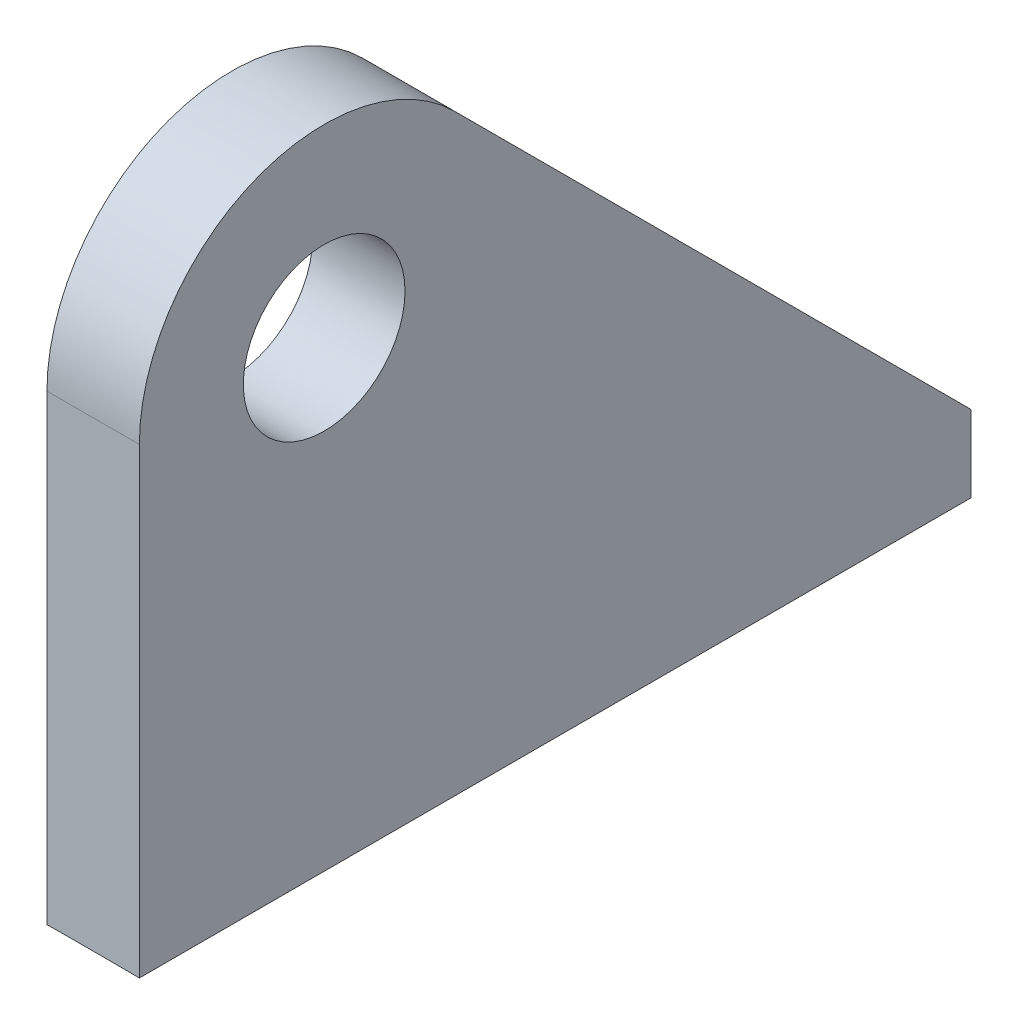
ISO-10303-21;
HEADER;
FILE_DESCRIPTION(('STEP AP214'),'2;1');
FILE_NAME('part.step','',(''),(''),'','','');
FILE_SCHEMA(('AUTOMOTIVE_DESIGN { 1 0 10303 214 1 1 1 1 }'));
ENDSEC;
DATA;
#1=APPLICATION_CONTEXT('core data for automotive mechanical design processes');
#2=APPLICATION_PROTOCOL_DEFINITION('international standard','automotive_design',2000,#1);
#3=PRODUCT_CONTEXT('',#1,'mechanical');
#4=PRODUCT('Part','Part','',(#3));
#5=PRODUCT_RELATED_PRODUCT_CATEGORY('part','',(#4));
#6=PRODUCT_DEFINITION_FORMATION('','',#4);
#7=PRODUCT_DEFINITION_CONTEXT('part definition',#1,'design');
#8=PRODUCT_DEFINITION('design','',#6,#7);
#9=PRODUCT_DEFINITION_SHAPE('','',#8);
#10=(LENGTH_UNIT() NAMED_UNIT(*) SI_UNIT(.MILLI.,.METRE.));
#11=(NAMED_UNIT(*) PLANE_ANGLE_UNIT() SI_UNIT($,.RADIAN.));
#12=(NAMED_UNIT(*) SI_UNIT($,.STERADIAN.) SOLID_ANGLE_UNIT());
#13=UNCERTAINTY_MEASURE_WITH_UNIT(LENGTH_MEASURE(1.E-05),#10,'distance_accuracy_value','');
#14=(GEOMETRIC_REPRESENTATION_CONTEXT(3) GLOBAL_UNCERTAINTY_ASSIGNED_CONTEXT((#13)) GLOBAL_UNIT_ASSIGNED_CONTEXT((#10,
#11,#12)) REPRESENTATION_CONTEXT('',''));
#15=CARTESIAN_POINT('',(0.,0.,0.));
#16=DIRECTION('',(0.,0.,1.));
#17=DIRECTION('',(1.,0.,0.));
#18=AXIS2_PLACEMENT_3D('',#15,#16,#17);
#19=CARTESIAN_POINT('',(12.7,127.,-50.8));
#20=DIRECTION('',(-1.,0.,0.));
#21=DIRECTION('',(0.,0.,1.));
#22=AXIS2_PLACEMENT_3D('',#19,#20,#21);
#23=PLANE('',#22);
#24=CARTESIAN_POINT('',(12.7,127.,-50.8));
#25=DIRECTION('',(1.,0.,0.));
#26=DIRECTION('',(0.,0.,1.));
#27=AXIS2_PLACEMENT_3D('',#24,#25,#26);
#28=CIRCLE('',#27,50.8);
#29=CARTESIAN_POINT('',(12.7,162.921024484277,-86.7210244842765));
#30=VERTEX_POINT('',#29);
#31=CARTESIAN_POINT('',(12.7,127.,0.));
#32=VERTEX_POINT('',#31);
#33=EDGE_CURVE('E118',#30,#32,#28,.T.);
#34=ORIENTED_EDGE('',*,*,#33,.T.);
#35=DIRECTION('',(0.,-1.,0.));
#36=VECTOR('',#35,1.);
#37=CARTESIAN_POINT('',(12.7,127.,0.));
#38=LINE('',#37,#36);
#39=CARTESIAN_POINT('',(12.7000000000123,0.,0.));
#40=VERTEX_POINT('',#39);
#41=EDGE_CURVE('E79',#32,#40,#38,.T.);
#42=ORIENTED_EDGE('',*,*,#41,.T.);
#43=DIRECTION('',(0.,0.,-1.));
#44=VECTOR('',#43,1.);
#45=CARTESIAN_POINT('',(12.7,0.,0.));
#46=LINE('',#45,#44);
#47=CARTESIAN_POINT('',(12.7000000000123,0.,-228.6));
#48=VERTEX_POINT('',#47);
#49=EDGE_CURVE('E92',#40,#48,#46,.T.);
#50=ORIENTED_EDGE('',*,*,#49,.T.);
#51=DIRECTION('',(0.,1.,0.));
#52=VECTOR('',#51,1.);
#53=CARTESIAN_POINT('',(12.7,0.,-228.6));
#54=LINE('',#53,#52);
#55=CARTESIAN_POINT('',(12.7,21.0420489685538,-228.6));
#56=VERTEX_POINT('',#55);
#57=EDGE_CURVE('E100',#48,#56,#54,.T.);
#58=ORIENTED_EDGE('',*,*,#57,.T.);
#59=DIRECTION('',(0.,0.707106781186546,0.707106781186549));
#60=VECTOR('',#59,1.);
#61=CARTESIAN_POINT('',(12.7,21.0420489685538,-228.6));
#62=LINE('',#61,#60);
#63=EDGE_CURVE('E50',#56,#30,#62,.T.);
#64=ORIENTED_EDGE('',*,*,#63,.T.);
#65=EDGE_LOOP('',(#34,#42,#50,#58,#64));
#66=FACE_BOUND('',#65,.T.);
#67=CARTESIAN_POINT('',(12.7,127.,-50.8));
#68=DIRECTION('',(1.,0.,0.));
#69=DIRECTION('',(0.,0.,-1.));
#70=AXIS2_PLACEMENT_3D('',#67,#68,#69);
#71=CIRCLE('',#70,22.225);
#72=CARTESIAN_POINT('',(12.7,127.,-73.025));
#73=VERTEX_POINT('',#72);
#74=EDGE_CURVE('E112',#73,#73,#71,.T.);
#75=ORIENTED_EDGE('',*,*,#74,.F.);
#76=EDGE_LOOP('',(#75));
#77=FACE_BOUND('',#76,.T.);
#78=ADVANCED_FACE('F33',(#66,#77),#23,.F.);
#79=CARTESIAN_POINT('',(-12.7,127.,-50.8));
#80=DIRECTION('',(-1.,0.,0.));
#81=DIRECTION('',(0.,0.,1.));
#82=AXIS2_PLACEMENT_3D('',#79,#80,#81);
#83=PLANE('',#82);
#84=CARTESIAN_POINT('',(-12.7,127.,-50.8));
#85=DIRECTION('',(1.,0.,0.));
#86=DIRECTION('',(0.,0.,1.));
#87=AXIS2_PLACEMENT_3D('',#84,#85,#86);
#88=CIRCLE('',#87,50.8);
#89=CARTESIAN_POINT('',(-12.7,162.921024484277,-86.7210244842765));
#90=VERTEX_POINT('',#89);
#91=CARTESIAN_POINT('',(-12.7,127.,0.));
#92=VERTEX_POINT('',#91);
#93=EDGE_CURVE('E108',#90,#92,#88,.T.);
#94=ORIENTED_EDGE('',*,*,#93,.F.);
#95=DIRECTION('',(0.,0.707106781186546,0.707106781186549));
#96=VECTOR('',#95,1.);
#97=CARTESIAN_POINT('',(-12.7,21.0420489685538,-228.6));
#98=LINE('',#97,#96);
#99=CARTESIAN_POINT('',(-12.7,21.0420489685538,-228.6));
#100=VERTEX_POINT('',#99);
#101=EDGE_CURVE('E73',#100,#90,#98,.T.);
#102=ORIENTED_EDGE('',*,*,#101,.F.);
#103=DIRECTION('',(0.,1.,0.));
#104=VECTOR('',#103,1.);
#105=CARTESIAN_POINT('',(-12.7,0.,-228.6));
#106=LINE('',#105,#104);
#107=CARTESIAN_POINT('',(-12.7,0.,-228.6));
#108=VERTEX_POINT('',#107);
#109=EDGE_CURVE('E68',#108,#100,#106,.T.);
#110=ORIENTED_EDGE('',*,*,#109,.F.);
#111=DIRECTION('',(0.,0.,-1.));
#112=VECTOR('',#111,1.);
#113=CARTESIAN_POINT('',(-12.7,0.,0.));
#114=LINE('',#113,#112);
#115=CARTESIAN_POINT('',(-12.7000000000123,0.,0.));
#116=VERTEX_POINT('',#115);
#117=EDGE_CURVE('E94',#116,#108,#114,.T.);
#118=ORIENTED_EDGE('',*,*,#117,.F.);
#119=DIRECTION('',(0.,-1.,0.));
#120=VECTOR('',#119,1.);
#121=CARTESIAN_POINT('',(-12.7,127.,0.));
#122=LINE('',#121,#120);
#123=EDGE_CURVE('E111',#92,#116,#122,.T.);
#124=ORIENTED_EDGE('',*,*,#123,.F.);
#125=EDGE_LOOP('',(#94,#102,#110,#118,#124));
#126=FACE_BOUND('',#125,.T.);
#127=CARTESIAN_POINT('',(-12.7,127.,-50.8));
#128=DIRECTION('',(1.,0.,0.));
#129=DIRECTION('',(0.,0.,-1.));
#130=AXIS2_PLACEMENT_3D('',#127,#128,#129);
#131=CIRCLE('',#130,22.225);
#132=CARTESIAN_POINT('',(-12.7,127.,-73.025));
#133=VERTEX_POINT('',#132);
#134=EDGE_CURVE('E96',#133,#133,#131,.T.);
#135=ORIENTED_EDGE('',*,*,#134,.T.);
#136=EDGE_LOOP('',(#135));
#137=FACE_BOUND('',#136,.T.);
#138=ADVANCED_FACE('F122',(#126,#137),#83,.T.);
#139=CARTESIAN_POINT('',(12.7,127.,-50.8));
#140=DIRECTION('',(-1.,0.,0.));
#141=DIRECTION('',(0.,0.,1.));
#142=AXIS2_PLACEMENT_3D('',#139,#140,#141);
#143=CYLINDRICAL_SURFACE('',#142,50.8);
#144=ORIENTED_EDGE('',*,*,#93,.T.);
#145=DIRECTION('',(-1.,0.,0.));
#146=VECTOR('',#145,1.);
#147=CARTESIAN_POINT('',(12.7,127.,0.));
#148=LINE('',#147,#146);
#149=EDGE_CURVE('E11',#32,#92,#148,.T.);
#150=ORIENTED_EDGE('',*,*,#149,.F.);
#151=ORIENTED_EDGE('',*,*,#33,.F.);
#152=DIRECTION('',(-1.,0.,0.));
#153=VECTOR('',#152,1.);
#154=CARTESIAN_POINT('',(12.7,162.921024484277,-86.7210244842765));
#155=LINE('',#154,#153);
#156=EDGE_CURVE('E104',#30,#90,#155,.T.);
#157=ORIENTED_EDGE('',*,*,#156,.T.);
#158=EDGE_LOOP('',(#144,#150,#151,#157));
#159=FACE_BOUND('',#158,.T.);
#160=ADVANCED_FACE('F35',(#159),#143,.T.);
#161=CARTESIAN_POINT('',(12.7,127.,0.));
#162=DIRECTION('',(0.,0.,-1.));
#163=DIRECTION('',(0.,1.,0.));
#164=AXIS2_PLACEMENT_3D('',#161,#162,#163);
#165=PLANE('',#164);
#166=ORIENTED_EDGE('',*,*,#123,.T.);
#167=CARTESIAN_POINT('',(0.,-1523.94708241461,0.));
#168=DIRECTION('',(0.,0.,1.));
#169=DIRECTION('',(1.,0.,0.));
#170=AXIS2_PLACEMENT_3D('',#167,#168,#169);
#171=CIRCLE('',#170,1524.);
#172=EDGE_CURVE('E97',#40,#116,#171,.T.);
#173=ORIENTED_EDGE('',*,*,#172,.F.);
#174=ORIENTED_EDGE('',*,*,#41,.F.);
#175=ORIENTED_EDGE('',*,*,#149,.T.);
#176=EDGE_LOOP('',(#166,#173,#174,#175));
#177=FACE_BOUND('',#176,.T.);
#178=ADVANCED_FACE('F133',(#177),#165,.F.);
#179=CARTESIAN_POINT('',(12.7,0.,-228.6));
#180=DIRECTION('',(0.,0.,1.));
#181=DIRECTION('',(0.,-1.,0.));
#182=AXIS2_PLACEMENT_3D('',#179,#180,#181);
#183=PLANE('',#182);
#184=ORIENTED_EDGE('',*,*,#57,.F.);
#185=CARTESIAN_POINT('',(0.,-1523.94708241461,-228.6));
#186=DIRECTION('',(0.,0.,1.));
#187=DIRECTION('',(1.,0.,0.));
#188=AXIS2_PLACEMENT_3D('',#185,#186,#187);
#189=CIRCLE('',#188,1524.);
#190=EDGE_CURVE('E89',#48,#108,#189,.T.);
#191=ORIENTED_EDGE('',*,*,#190,.T.);
#192=ORIENTED_EDGE('',*,*,#109,.T.);
#193=DIRECTION('',(-1.,0.,0.));
#194=VECTOR('',#193,1.);
#195=CARTESIAN_POINT('',(12.7,21.0420489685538,-228.6));
#196=LINE('',#195,#194);
#197=EDGE_CURVE('E42',#56,#100,#196,.T.);
#198=ORIENTED_EDGE('',*,*,#197,.F.);
#199=EDGE_LOOP('',(#184,#191,#192,#198));
#200=FACE_BOUND('',#199,.T.);
#201=ADVANCED_FACE('F102',(#200),#183,.F.);
#202=CARTESIAN_POINT('',(12.7,21.0420489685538,-228.6));
#203=DIRECTION('',(0.,-0.707106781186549,0.707106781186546));
#204=DIRECTION('',(0.,-0.707106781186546,-0.707106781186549));
#205=AXIS2_PLACEMENT_3D('',#202,#203,#204);
#206=PLANE('',#205);
#207=ORIENTED_EDGE('',*,*,#101,.T.);
#208=ORIENTED_EDGE('',*,*,#156,.F.);
#209=ORIENTED_EDGE('',*,*,#63,.F.);
#210=ORIENTED_EDGE('',*,*,#197,.T.);
#211=EDGE_LOOP('',(#207,#208,#209,#210));
#212=FACE_BOUND('',#211,.T.);
#213=ADVANCED_FACE('F119',(#212),#206,.F.);
#214=CARTESIAN_POINT('',(12.7,127.,-50.8));
#215=DIRECTION('',(-1.,0.,0.));
#216=DIRECTION('',(0.,0.,1.));
#217=AXIS2_PLACEMENT_3D('',#214,#215,#216);
#218=CYLINDRICAL_SURFACE('',#217,22.225);
#219=ORIENTED_EDGE('',*,*,#74,.T.);
#220=EDGE_LOOP('',(#219));
#221=FACE_BOUND('',#220,.T.);
#222=ORIENTED_EDGE('',*,*,#134,.F.);
#223=EDGE_LOOP('',(#222));
#224=FACE_BOUND('',#223,.T.);
#225=ADVANCED_FACE('F147',(#221,#224),#218,.F.);
#226=CARTESIAN_POINT('',(0.,-1523.94708241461,-228.6));
#227=DIRECTION('',(0.,0.,1.));
#228=DIRECTION('',(1.,0.,0.));
#229=AXIS2_PLACEMENT_3D('',#226,#227,#228);
#230=CYLINDRICAL_SURFACE('',#229,1524.);
#231=ORIENTED_EDGE('',*,*,#190,.F.);
#232=ORIENTED_EDGE('',*,*,#49,.F.);
#233=ORIENTED_EDGE('',*,*,#172,.T.);
#234=ORIENTED_EDGE('',*,*,#117,.T.);
#235=EDGE_LOOP('',(#231,#232,#233,#234));
#236=FACE_BOUND('',#235,.T.);
#237=ADVANCED_FACE('F91',(#236),#230,.F.);
#238=CLOSED_SHELL('',(#78,#138,#160,#178,#201,#213,#225,#237));
#239=MANIFOLD_SOLID_BREP('B2',#238);
#240=ADVANCED_BREP_SHAPE_REPRESENTATION('',(#18,#239),#14);
#241=SHAPE_DEFINITION_REPRESENTATION(#9,#240);
ENDSEC;
END-ISO-10303-21;
